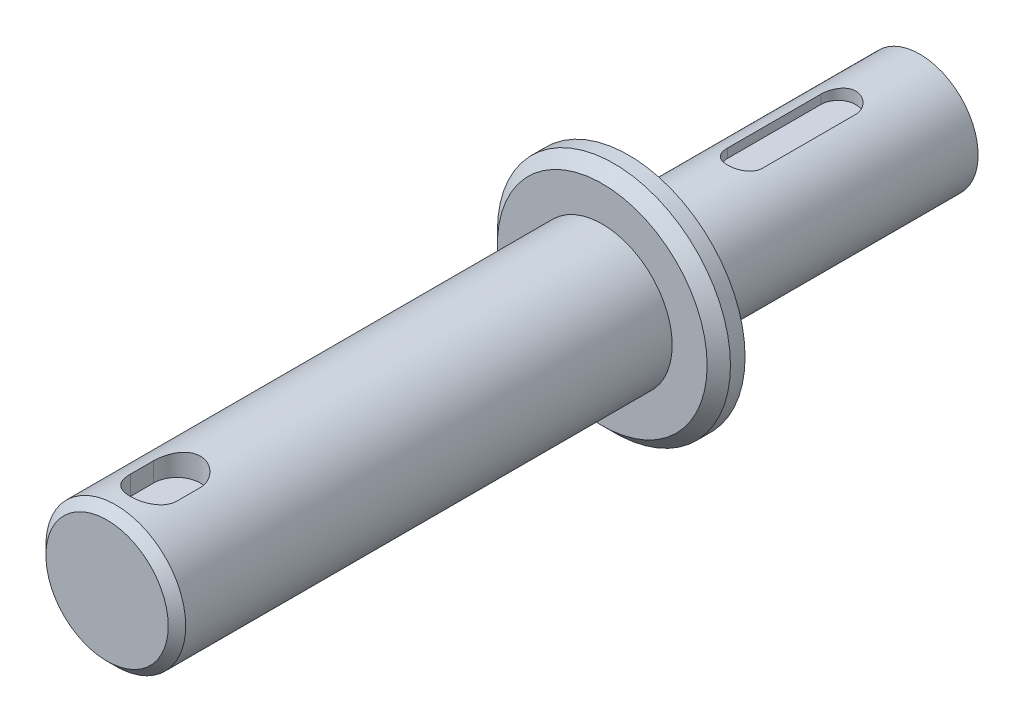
ISO-10303-21;
HEADER;
FILE_DESCRIPTION(('STEP AP214'),'2;1');
FILE_NAME('part.step','',(''),(''),'','','');
FILE_SCHEMA(('AUTOMOTIVE_DESIGN { 1 0 10303 214 1 1 1 1 }'));
ENDSEC;
DATA;
#1=APPLICATION_CONTEXT('core data for automotive mechanical design processes');
#2=APPLICATION_PROTOCOL_DEFINITION('international standard','automotive_design',2000,#1);
#3=PRODUCT_CONTEXT('',#1,'mechanical');
#4=PRODUCT('Part','Part','',(#3));
#5=PRODUCT_RELATED_PRODUCT_CATEGORY('part','',(#4));
#6=PRODUCT_DEFINITION_FORMATION('','',#4);
#7=PRODUCT_DEFINITION_CONTEXT('part definition',#1,'design');
#8=PRODUCT_DEFINITION('design','',#6,#7);
#9=PRODUCT_DEFINITION_SHAPE('','',#8);
#10=(LENGTH_UNIT() NAMED_UNIT(*) SI_UNIT(.MILLI.,.METRE.));
#11=(NAMED_UNIT(*) PLANE_ANGLE_UNIT() SI_UNIT($,.RADIAN.));
#12=(NAMED_UNIT(*) SI_UNIT($,.STERADIAN.) SOLID_ANGLE_UNIT());
#13=UNCERTAINTY_MEASURE_WITH_UNIT(LENGTH_MEASURE(1.E-05),#10,'distance_accuracy_value','');
#14=(GEOMETRIC_REPRESENTATION_CONTEXT(3) GLOBAL_UNCERTAINTY_ASSIGNED_CONTEXT((#13)) GLOBAL_UNIT_ASSIGNED_CONTEXT((#10,
#11,#12)) REPRESENTATION_CONTEXT('',''));
#15=CARTESIAN_POINT('',(0.,0.,0.));
#16=DIRECTION('',(0.,0.,1.));
#17=DIRECTION('',(1.,0.,0.));
#18=AXIS2_PLACEMENT_3D('',#15,#16,#17);
#19=CARTESIAN_POINT('',(0.,0.,89.51));
#20=DIRECTION('',(0.,0.,-1.));
#21=DIRECTION('',(-1.,0.,0.));
#22=AXIS2_PLACEMENT_3D('',#19,#20,#21);
#23=CYLINDRICAL_SURFACE('',#22,12.);
#24=CARTESIAN_POINT('',(0.,0.,4.51));
#25=DIRECTION('',(0.,0.,1.));
#26=DIRECTION('',(1.,0.,0.));
#27=AXIS2_PLACEMENT_3D('',#24,#25,#26);
#28=CIRCLE('',#27,12.);
#29=CARTESIAN_POINT('',(12.,0.,4.51));
#30=VERTEX_POINT('',#29);
#31=EDGE_CURVE('E157',#30,#30,#28,.T.);
#32=ORIENTED_EDGE('',*,*,#31,.T.);
#33=EDGE_LOOP('',(#32));
#34=FACE_BOUND('',#33,.T.);
#35=CARTESIAN_POINT('',(0.,0.,88.01));
#36=DIRECTION('',(0.,0.,1.));
#37=DIRECTION('',(1.,0.,0.));
#38=AXIS2_PLACEMENT_3D('',#35,#36,#37);
#39=CIRCLE('',#38,12.);
#40=CARTESIAN_POINT('',(12.,0.,88.01));
#41=VERTEX_POINT('',#40);
#42=EDGE_CURVE('E173',#41,#41,#39,.F.);
#43=ORIENTED_EDGE('',*,*,#42,.T.);
#44=EDGE_LOOP('',(#43));
#45=FACE_BOUND('',#44,.T.);
#46=CARTESIAN_POINT('',(-4.,11.3137084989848,81.51));
#47=CARTESIAN_POINT('',(-4.0000143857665,11.3136910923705,81.6191313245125));
#48=CARTESIAN_POINT('',(-3.99553419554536,11.3152871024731,81.7282529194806));
#49=CARTESIAN_POINT('',(-3.97769673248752,11.3215763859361,81.9456496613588));
#50=CARTESIAN_POINT('',(-3.96434185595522,11.3262688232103,82.0539250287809));
#51=CARTESIAN_POINT('',(-3.92891935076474,11.3386032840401,82.2685447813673));
#52=CARTESIAN_POINT('',(-3.90687756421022,11.3462365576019,82.3748939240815));
#53=CARTESIAN_POINT('',(-3.85430689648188,11.364201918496,82.5852132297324));
#54=CARTESIAN_POINT('',(-3.82377770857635,11.3745341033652,82.6891833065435));
#55=CARTESIAN_POINT('',(-3.71986482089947,11.4091190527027,82.9963385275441));
#56=CARTESIAN_POINT('',(-3.63410266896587,11.4369799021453,83.195086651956));
#57=CARTESIAN_POINT('',(-3.4322845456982,11.4991525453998,83.5754028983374));
#58=CARTESIAN_POINT('',(-3.31620997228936,11.5334682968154,83.756960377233));
#59=CARTESIAN_POINT('',(-3.05220793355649,11.6061789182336,84.1048686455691));
#60=CARTESIAN_POINT('',(-2.90330055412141,11.6446750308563,84.2704562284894));
#61=CARTESIAN_POINT('',(-2.57995313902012,11.7205540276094,84.5748273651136));
#62=CARTESIAN_POINT('',(-2.40550856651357,11.7579367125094,84.713606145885));
#63=CARTESIAN_POINT('',(-2.03041476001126,11.8285552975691,84.9639171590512));
#64=CARTESIAN_POINT('',(-1.82920040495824,11.8616574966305,85.0746436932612));
#65=CARTESIAN_POINT('',(-1.40971695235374,11.9187843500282,85.2603692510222));
#66=CARTESIAN_POINT('',(-1.19145308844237,11.9428117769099,85.3353791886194));
#67=CARTESIAN_POINT('',(-0.752117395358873,11.9783628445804,85.4449428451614));
#68=CARTESIAN_POINT('',(-0.531407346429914,11.9902923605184,85.4808130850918));
#69=CARTESIAN_POINT('',(-0.0867958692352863,12.0017443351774,85.5152651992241));
#70=CARTESIAN_POINT('',(0.13710478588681,12.0012697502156,85.5138559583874));
#71=CARTESIAN_POINT('',(0.572415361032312,11.9882415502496,85.4746229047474));
#72=CARTESIAN_POINT('',(0.783970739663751,11.9761624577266,85.4382295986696));
#73=CARTESIAN_POINT('',(1.19777632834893,11.9418784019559,85.3324270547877));
#74=CARTESIAN_POINT('',(1.4000260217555,11.9196728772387,85.2630159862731));
#75=CARTESIAN_POINT('',(1.79261022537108,11.8670267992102,85.0923150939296));
#76=CARTESIAN_POINT('',(1.98275302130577,11.8364817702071,84.9906179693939));
#77=CARTESIAN_POINT('',(2.34369935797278,11.7703352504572,84.7585580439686));
#78=CARTESIAN_POINT('',(2.51449761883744,11.7347323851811,84.6281874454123));
#79=CARTESIAN_POINT('',(2.84038544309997,11.6602518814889,84.3353242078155));
#80=CARTESIAN_POINT('',(2.99435951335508,11.6212989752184,84.1716098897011));
#81=CARTESIAN_POINT('',(3.27310303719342,11.5458957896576,83.8202019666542));
#82=CARTESIAN_POINT('',(3.39786305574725,11.5094463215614,83.6325006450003));
#83=CARTESIAN_POINT('',(3.56109757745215,11.4595759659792,83.3352870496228));
#84=CARTESIAN_POINT('',(3.61182358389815,11.4436484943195,83.2327445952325));
#85=CARTESIAN_POINT('',(3.70440095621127,11.4140167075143,83.0234350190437));
#86=CARTESIAN_POINT('',(3.74625601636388,11.4003114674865,82.9166696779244));
#87=CARTESIAN_POINT('',(3.82067426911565,11.3755873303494,82.6997829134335));
#88=CARTESIAN_POINT('',(3.85324757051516,11.3645655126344,82.5896652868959));
#89=CARTESIAN_POINT('',(3.90883841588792,11.3455648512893,82.3668318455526));
#90=CARTESIAN_POINT('',(3.93186032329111,11.3375846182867,82.2541172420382));
#91=CARTESIAN_POINT('',(3.96661962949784,11.3254693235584,82.0363575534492));
#92=CARTESIAN_POINT('',(3.97913375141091,11.3210705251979,81.9314504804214));
#93=CARTESIAN_POINT('',(3.99582494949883,11.3151843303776,81.7210316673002));
#94=CARTESIAN_POINT('',(4.00001278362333,11.3136931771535,81.6155208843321));
#95=CARTESIAN_POINT('',(4.,11.3137084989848,81.51));
#96=B_SPLINE_CURVE_WITH_KNOTS('',3,(#46,#47,#48,#49,#50,#51,#52,#53,#54,#55,#56,#57,#58,#59,#60,
#61,#62,#63,#64,#65,#66,#67,#68,#69,#70,#71,#72,#73,#74,#75,#76,#77,#78,#79,#80,#81,#82,#83,#84,
#85,#86,#87,#88,#89,#90,#91,#92,#93,#94,#95),.UNSPECIFIED.,.F.,.F.,(4,2,2,2,2,2,2,2,2,2,2,2,2,2,
2,2,2,2,2,2,2,2,2,2,4),(0.,0.327273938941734,0.654459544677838,0.980679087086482,
1.30691042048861,1.95841627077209,2.61032287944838,3.28524582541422,3.96028882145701,
4.65295094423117,5.34540127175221,6.01376445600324,6.68196834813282,7.32396236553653,
7.96599198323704,8.61646637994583,9.26711789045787,9.94834778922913,10.6297973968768,
10.9759539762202,11.3219661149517,11.6675999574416,12.0130757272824,12.3299368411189,
12.6463882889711),.UNSPECIFIED.);
#97=CARTESIAN_POINT('',(-4.,11.3137084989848,81.51));
#98=VERTEX_POINT('',#97);
#99=CARTESIAN_POINT('',(4.,11.3137084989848,81.51));
#100=VERTEX_POINT('',#99);
#101=EDGE_CURVE('E138',#98,#100,#96,.T.);
#102=ORIENTED_EDGE('',*,*,#101,.F.);
#103=DIRECTION('',(0.,0.,-1.));
#104=VECTOR('',#103,1.);
#105=CARTESIAN_POINT('',(-4.,11.3137084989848,89.51));
#106=LINE('',#105,#104);
#107=CARTESIAN_POINT('',(-4.,11.3137084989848,77.51));
#108=VERTEX_POINT('',#107);
#109=EDGE_CURVE('E176',#108,#98,#106,.F.);
#110=ORIENTED_EDGE('',*,*,#109,.F.);
#111=CARTESIAN_POINT('',(4.,11.3137084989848,77.51));
#112=CARTESIAN_POINT('',(4.0000143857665,11.3136910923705,77.4008686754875));
#113=CARTESIAN_POINT('',(3.99553419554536,11.3152871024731,77.2917470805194));
#114=CARTESIAN_POINT('',(3.97769673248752,11.3215763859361,77.0743503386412));
#115=CARTESIAN_POINT('',(3.96434185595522,11.3262688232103,76.9660749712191));
#116=CARTESIAN_POINT('',(3.92891935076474,11.3386032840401,76.7514552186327));
#117=CARTESIAN_POINT('',(3.90687756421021,11.3462365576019,76.6451060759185));
#118=CARTESIAN_POINT('',(3.85430689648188,11.364201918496,76.4347867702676));
#119=CARTESIAN_POINT('',(3.82377770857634,11.3745341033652,76.3308166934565));
#120=CARTESIAN_POINT('',(3.71986482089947,11.4091190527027,76.0236614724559));
#121=CARTESIAN_POINT('',(3.63410266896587,11.4369799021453,75.824913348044));
#122=CARTESIAN_POINT('',(3.4322845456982,11.4991525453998,75.4445971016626));
#123=CARTESIAN_POINT('',(3.31620997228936,11.5334682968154,75.263039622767));
#124=CARTESIAN_POINT('',(3.05220793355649,11.6061789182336,74.9151313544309));
#125=CARTESIAN_POINT('',(2.90330055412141,11.6446750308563,74.7495437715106));
#126=CARTESIAN_POINT('',(2.57995313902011,11.7205540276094,74.4451726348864));
#127=CARTESIAN_POINT('',(2.40550856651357,11.7579367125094,74.306393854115));
#128=CARTESIAN_POINT('',(2.03041476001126,11.8285552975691,74.0560828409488));
#129=CARTESIAN_POINT('',(1.82920040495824,11.8616574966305,73.9453563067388));
#130=CARTESIAN_POINT('',(1.40971695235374,11.9187843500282,73.7596307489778));
#131=CARTESIAN_POINT('',(1.19145308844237,11.9428117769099,73.6846208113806));
#132=CARTESIAN_POINT('',(0.752117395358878,11.9783628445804,73.5750571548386));
#133=CARTESIAN_POINT('',(0.531407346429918,11.9902923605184,73.5391869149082));
#134=CARTESIAN_POINT('',(0.0867958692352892,12.0017443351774,73.5047348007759));
#135=CARTESIAN_POINT('',(-0.137104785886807,12.0012697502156,73.5061440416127));
#136=CARTESIAN_POINT('',(-0.57241536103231,11.9882415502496,73.5453770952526));
#137=CARTESIAN_POINT('',(-0.783970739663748,11.9761624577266,73.5817704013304));
#138=CARTESIAN_POINT('',(-1.19777632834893,11.9418784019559,73.6875729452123));
#139=CARTESIAN_POINT('',(-1.40002602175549,11.9196728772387,73.7569840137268));
#140=CARTESIAN_POINT('',(-1.79261022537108,11.8670267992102,73.9276849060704));
#141=CARTESIAN_POINT('',(-1.98275302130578,11.8364817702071,74.0293820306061));
#142=CARTESIAN_POINT('',(-2.34369935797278,11.7703352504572,74.2614419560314));
#143=CARTESIAN_POINT('',(-2.51449761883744,11.7347323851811,74.3918125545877));
#144=CARTESIAN_POINT('',(-2.84038544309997,11.6602518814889,74.6846757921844));
#145=CARTESIAN_POINT('',(-2.99435951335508,11.6212989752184,74.8483901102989));
#146=CARTESIAN_POINT('',(-3.27310303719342,11.5458957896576,75.1997980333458));
#147=CARTESIAN_POINT('',(-3.39786305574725,11.5094463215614,75.3874993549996));
#148=CARTESIAN_POINT('',(-3.56109757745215,11.4595759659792,75.6847129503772));
#149=CARTESIAN_POINT('',(-3.61182358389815,11.4436484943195,75.7872554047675));
#150=CARTESIAN_POINT('',(-3.70440095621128,11.4140167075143,75.9965649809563));
#151=CARTESIAN_POINT('',(-3.74625601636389,11.4003114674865,76.1033303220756));
#152=CARTESIAN_POINT('',(-3.82067426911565,11.3755873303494,76.3202170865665));
#153=CARTESIAN_POINT('',(-3.85324757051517,11.3645655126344,76.4303347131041));
#154=CARTESIAN_POINT('',(-3.90883841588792,11.3455648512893,76.6531681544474));
#155=CARTESIAN_POINT('',(-3.93186032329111,11.3375846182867,76.7658827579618));
#156=CARTESIAN_POINT('',(-3.96661962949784,11.3254693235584,76.9836424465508));
#157=CARTESIAN_POINT('',(-3.97913375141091,11.3210705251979,77.0885495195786));
#158=CARTESIAN_POINT('',(-3.99582494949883,11.3151843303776,77.2989683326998));
#159=CARTESIAN_POINT('',(-4.00001278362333,11.3136931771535,77.4044791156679));
#160=CARTESIAN_POINT('',(-4.,11.3137084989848,77.51));
#161=B_SPLINE_CURVE_WITH_KNOTS('',3,(#111,#112,#113,#114,#115,#116,#117,#118,#119,#120,#121,
#122,#123,#124,#125,#126,#127,#128,#129,#130,#131,#132,#133,#134,#135,#136,#137,#138,#139,#140,
#141,#142,#143,#144,#145,#146,#147,#148,#149,#150,#151,#152,#153,#154,#155,#156,#157,#158,#159,
#160),.UNSPECIFIED.,.F.,.F.,(4,2,2,2,2,2,2,2,2,2,2,2,2,2,2,2,2,2,2,2,2,2,2,2,4),(0.,
0.327273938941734,0.654459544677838,0.98067908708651,1.30691042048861,1.95841627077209,
2.61032287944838,3.28524582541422,3.96028882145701,4.65295094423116,5.3454012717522,
6.01376445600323,6.68196834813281,7.32396236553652,7.96599198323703,8.61646637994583,
9.26711789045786,9.94834778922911,10.6297973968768,10.9759539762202,11.3219661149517,
11.6675999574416,12.0130757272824,12.3299368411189,12.6463882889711),.UNSPECIFIED.);
#162=CARTESIAN_POINT('',(4.,11.3137084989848,77.51));
#163=VERTEX_POINT('',#162);
#164=EDGE_CURVE('E178',#163,#108,#161,.T.);
#165=ORIENTED_EDGE('',*,*,#164,.F.);
#166=DIRECTION('',(0.,0.,-1.));
#167=VECTOR('',#166,1.);
#168=CARTESIAN_POINT('',(4.,11.3137084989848,89.51));
#169=LINE('',#168,#167);
#170=EDGE_CURVE('E186',#100,#163,#169,.T.);
#171=ORIENTED_EDGE('',*,*,#170,.F.);
#172=EDGE_LOOP('',(#102,#110,#165,#171));
#173=FACE_BOUND('',#172,.T.);
#174=ADVANCED_FACE('F34',(#34,#45,#173),#23,.T.);
#175=CARTESIAN_POINT('',(0.,0.,4.51));
#176=DIRECTION('',(0.,0.,-1.));
#177=DIRECTION('',(-1.,0.,0.));
#178=AXIS2_PLACEMENT_3D('',#175,#176,#177);
#179=CYLINDRICAL_SURFACE('',#178,20.);
#180=CARTESIAN_POINT('',(0.,0.,2.50999999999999));
#181=DIRECTION('',(0.,0.,1.));
#182=DIRECTION('',(1.,0.,0.));
#183=AXIS2_PLACEMENT_3D('',#180,#181,#182);
#184=CIRCLE('',#183,20.);
#185=CARTESIAN_POINT('',(20.,0.,2.50999999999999));
#186=VERTEX_POINT('',#185);
#187=EDGE_CURVE('E166',#186,#186,#184,.F.);
#188=ORIENTED_EDGE('',*,*,#187,.T.);
#189=EDGE_LOOP('',(#188));
#190=FACE_BOUND('',#189,.T.);
#191=CARTESIAN_POINT('',(0.,0.,0.));
#192=DIRECTION('',(0.,0.,1.));
#193=DIRECTION('',(1.,0.,0.));
#194=AXIS2_PLACEMENT_3D('',#191,#192,#193);
#195=CIRCLE('',#194,20.);
#196=CARTESIAN_POINT('',(20.,0.,0.));
#197=VERTEX_POINT('',#196);
#198=EDGE_CURVE('E160',#197,#197,#195,.T.);
#199=ORIENTED_EDGE('',*,*,#198,.T.);
#200=EDGE_LOOP('',(#199));
#201=FACE_BOUND('',#200,.T.);
#202=ADVANCED_FACE('F249',(#190,#201),#179,.T.);
#203=CARTESIAN_POINT('',(0.,0.,4.51));
#204=DIRECTION('',(0.,0.,1.));
#205=DIRECTION('',(1.,0.,0.));
#206=AXIS2_PLACEMENT_3D('',#203,#204,#205);
#207=PLANE('',#206);
#208=ORIENTED_EDGE('',*,*,#31,.F.);
#209=EDGE_LOOP('',(#208));
#210=FACE_BOUND('',#209,.T.);
#211=CARTESIAN_POINT('',(0.,0.,4.51));
#212=DIRECTION('',(0.,0.,1.));
#213=DIRECTION('',(1.,0.,0.));
#214=AXIS2_PLACEMENT_3D('',#211,#212,#213);
#215=CIRCLE('',#214,18.);
#216=CARTESIAN_POINT('',(18.,0.,4.51));
#217=VERTEX_POINT('',#216);
#218=EDGE_CURVE('E163',#217,#217,#215,.T.);
#219=ORIENTED_EDGE('',*,*,#218,.T.);
#220=EDGE_LOOP('',(#219));
#221=FACE_BOUND('',#220,.T.);
#222=ADVANCED_FACE('F254',(#210,#221),#207,.T.);
#223=CARTESIAN_POINT('',(0.,0.,0.));
#224=DIRECTION('',(0.,0.,1.));
#225=DIRECTION('',(1.,0.,0.));
#226=AXIS2_PLACEMENT_3D('',#223,#224,#225);
#227=PLANE('',#226);
#228=CARTESIAN_POINT('',(0.,0.,0.));
#229=DIRECTION('',(0.,0.,-1.));
#230=DIRECTION('',(-1.,0.,0.));
#231=AXIS2_PLACEMENT_3D('',#228,#229,#230);
#232=CIRCLE('',#231,10.);
#233=CARTESIAN_POINT('',(-10.,0.,0.));
#234=VERTEX_POINT('',#233);
#235=EDGE_CURVE('E134',#234,#234,#232,.T.);
#236=ORIENTED_EDGE('',*,*,#235,.F.);
#237=EDGE_LOOP('',(#236));
#238=FACE_BOUND('',#237,.T.);
#239=ORIENTED_EDGE('',*,*,#198,.F.);
#240=EDGE_LOOP('',(#239));
#241=FACE_BOUND('',#240,.T.);
#242=ADVANCED_FACE('F327',(#238,#241),#227,.F.);
#243=CARTESIAN_POINT('',(0.,0.,4.51));
#244=DIRECTION('',(0.,0.,-1.));
#245=DIRECTION('',(-1.,0.,0.));
#246=AXIS2_PLACEMENT_3D('',#243,#244,#245);
#247=CONICAL_SURFACE('',#246,18.,0.785398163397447);
#248=ORIENTED_EDGE('',*,*,#187,.F.);
#249=EDGE_LOOP('',(#248));
#250=FACE_BOUND('',#249,.T.);
#251=ORIENTED_EDGE('',*,*,#218,.F.);
#252=EDGE_LOOP('',(#251));
#253=FACE_BOUND('',#252,.T.);
#254=ADVANCED_FACE('F330',(#250,#253),#247,.T.);
#255=CARTESIAN_POINT('',(0.,0.,89.51));
#256=DIRECTION('',(0.,0.,1.));
#257=DIRECTION('',(1.,0.,0.));
#258=AXIS2_PLACEMENT_3D('',#255,#256,#257);
#259=PLANE('',#258);
#260=CARTESIAN_POINT('',(0.,0.,89.51));
#261=DIRECTION('',(0.,0.,1.));
#262=DIRECTION('',(1.,0.,0.));
#263=AXIS2_PLACEMENT_3D('',#260,#261,#262);
#264=CIRCLE('',#263,10.5);
#265=CARTESIAN_POINT('',(10.5,0.,89.51));
#266=VERTEX_POINT('',#265);
#267=EDGE_CURVE('E169',#266,#266,#264,.T.);
#268=ORIENTED_EDGE('',*,*,#267,.T.);
#269=EDGE_LOOP('',(#268));
#270=FACE_BOUND('',#269,.T.);
#271=ADVANCED_FACE('F207',(#270),#259,.T.);
#272=CARTESIAN_POINT('',(0.,0.,89.51));
#273=DIRECTION('',(0.,0.,-1.));
#274=DIRECTION('',(-1.,0.,0.));
#275=AXIS2_PLACEMENT_3D('',#272,#273,#274);
#276=CONICAL_SURFACE('',#275,10.5,0.785398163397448);
#277=ORIENTED_EDGE('',*,*,#42,.F.);
#278=EDGE_LOOP('',(#277));
#279=FACE_BOUND('',#278,.T.);
#280=ORIENTED_EDGE('',*,*,#267,.F.);
#281=EDGE_LOOP('',(#280));
#282=FACE_BOUND('',#281,.T.);
#283=ADVANCED_FACE('F36',(#279,#282),#276,.T.);
#284=CARTESIAN_POINT('',(0.,20.,81.51));
#285=DIRECTION('',(0.,-1.,0.));
#286=DIRECTION('',(0.,0.,-1.));
#287=AXIS2_PLACEMENT_3D('',#284,#285,#286);
#288=CYLINDRICAL_SURFACE('',#287,4.);
#289=ORIENTED_EDGE('',*,*,#101,.T.);
#290=DIRECTION('',(0.,-1.,0.));
#291=VECTOR('',#290,1.);
#292=CARTESIAN_POINT('',(4.,20.,81.51));
#293=LINE('',#292,#291);
#294=CARTESIAN_POINT('',(4.,8.,81.51));
#295=VERTEX_POINT('',#294);
#296=EDGE_CURVE('E155',#100,#295,#293,.T.);
#297=ORIENTED_EDGE('',*,*,#296,.T.);
#298=CARTESIAN_POINT('',(0.,8.,81.51));
#299=DIRECTION('',(0.,1.,0.));
#300=DIRECTION('',(0.,0.,1.));
#301=AXIS2_PLACEMENT_3D('',#298,#299,#300);
#302=CIRCLE('',#301,4.);
#303=CARTESIAN_POINT('',(-4.,8.,81.51));
#304=VERTEX_POINT('',#303);
#305=EDGE_CURVE('E133',#304,#295,#302,.T.);
#306=ORIENTED_EDGE('',*,*,#305,.F.);
#307=DIRECTION('',(0.,-1.,0.));
#308=VECTOR('',#307,1.);
#309=CARTESIAN_POINT('',(-4.,20.,81.51));
#310=LINE('',#309,#308);
#311=EDGE_CURVE('E150',#98,#304,#310,.T.);
#312=ORIENTED_EDGE('',*,*,#311,.F.);
#313=EDGE_LOOP('',(#289,#297,#306,#312));
#314=FACE_BOUND('',#313,.T.);
#315=ADVANCED_FACE('F202',(#314),#288,.F.);
#316=CARTESIAN_POINT('',(4.,20.,77.51));
#317=DIRECTION('',(-1.,0.,0.));
#318=DIRECTION('',(0.,0.,1.));
#319=AXIS2_PLACEMENT_3D('',#316,#317,#318);
#320=PLANE('',#319);
#321=ORIENTED_EDGE('',*,*,#170,.T.);
#322=DIRECTION('',(0.,-1.,0.));
#323=VECTOR('',#322,1.);
#324=CARTESIAN_POINT('',(4.,20.,77.51));
#325=LINE('',#324,#323);
#326=CARTESIAN_POINT('',(4.,8.,77.51));
#327=VERTEX_POINT('',#326);
#328=EDGE_CURVE('E153',#163,#327,#325,.T.);
#329=ORIENTED_EDGE('',*,*,#328,.T.);
#330=DIRECTION('',(0.,0.,-1.));
#331=VECTOR('',#330,1.);
#332=CARTESIAN_POINT('',(4.,8.,77.51));
#333=LINE('',#332,#331);
#334=EDGE_CURVE('E141',#295,#327,#333,.T.);
#335=ORIENTED_EDGE('',*,*,#334,.F.);
#336=ORIENTED_EDGE('',*,*,#296,.F.);
#337=EDGE_LOOP('',(#321,#329,#335,#336));
#338=FACE_BOUND('',#337,.T.);
#339=ADVANCED_FACE('F197',(#338),#320,.T.);
#340=CARTESIAN_POINT('',(0.,20.,77.51));
#341=DIRECTION('',(0.,-1.,0.));
#342=DIRECTION('',(0.,0.,-1.));
#343=AXIS2_PLACEMENT_3D('',#340,#341,#342);
#344=CYLINDRICAL_SURFACE('',#343,4.);
#345=ORIENTED_EDGE('',*,*,#164,.T.);
#346=DIRECTION('',(0.,-1.,0.));
#347=VECTOR('',#346,1.);
#348=CARTESIAN_POINT('',(-4.,20.,77.51));
#349=LINE('',#348,#347);
#350=CARTESIAN_POINT('',(-4.,8.,77.51));
#351=VERTEX_POINT('',#350);
#352=EDGE_CURVE('E57',#108,#351,#349,.T.);
#353=ORIENTED_EDGE('',*,*,#352,.T.);
#354=CARTESIAN_POINT('',(0.,8.,77.51));
#355=DIRECTION('',(0.,1.,0.));
#356=DIRECTION('',(0.,0.,1.));
#357=AXIS2_PLACEMENT_3D('',#354,#355,#356);
#358=CIRCLE('',#357,4.);
#359=EDGE_CURVE('E144',#327,#351,#358,.T.);
#360=ORIENTED_EDGE('',*,*,#359,.F.);
#361=ORIENTED_EDGE('',*,*,#328,.F.);
#362=EDGE_LOOP('',(#345,#353,#360,#361));
#363=FACE_BOUND('',#362,.T.);
#364=ADVANCED_FACE('F191',(#363),#344,.F.);
#365=CARTESIAN_POINT('',(-4.,20.,77.51));
#366=DIRECTION('',(1.,0.,0.));
#367=DIRECTION('',(0.,0.,-1.));
#368=AXIS2_PLACEMENT_3D('',#365,#366,#367);
#369=PLANE('',#368);
#370=ORIENTED_EDGE('',*,*,#109,.T.);
#371=ORIENTED_EDGE('',*,*,#311,.T.);
#372=DIRECTION('',(0.,0.,1.));
#373=VECTOR('',#372,1.);
#374=CARTESIAN_POINT('',(-4.,8.,77.51));
#375=LINE('',#374,#373);
#376=EDGE_CURVE('E147',#351,#304,#375,.T.);
#377=ORIENTED_EDGE('',*,*,#376,.F.);
#378=ORIENTED_EDGE('',*,*,#352,.F.);
#379=EDGE_LOOP('',(#370,#371,#377,#378));
#380=FACE_BOUND('',#379,.T.);
#381=ADVANCED_FACE('F196',(#380),#369,.T.);
#382=CARTESIAN_POINT('',(0.,8.,81.51));
#383=DIRECTION('',(0.,1.,0.));
#384=DIRECTION('',(0.,0.,1.));
#385=AXIS2_PLACEMENT_3D('',#382,#383,#384);
#386=PLANE('',#385);
#387=ORIENTED_EDGE('',*,*,#305,.T.);
#388=ORIENTED_EDGE('',*,*,#334,.T.);
#389=ORIENTED_EDGE('',*,*,#359,.T.);
#390=ORIENTED_EDGE('',*,*,#376,.T.);
#391=EDGE_LOOP('',(#387,#388,#389,#390));
#392=FACE_BOUND('',#391,.T.);
#393=ADVANCED_FACE('F246',(#392),#386,.T.);
#394=CARTESIAN_POINT('',(0.,0.,-50.));
#395=DIRECTION('',(0.,0.,1.));
#396=DIRECTION('',(1.,0.,0.));
#397=AXIS2_PLACEMENT_3D('',#394,#395,#396);
#398=CYLINDRICAL_SURFACE('',#397,10.);
#399=DIRECTION('',(0.,0.,1.));
#400=VECTOR('',#399,1.);
#401=CARTESIAN_POINT('',(-3.,9.53939201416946,-50.));
#402=LINE('',#401,#400);
#403=CARTESIAN_POINT('',(-3.,9.53939201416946,-20.));
#404=VERTEX_POINT('',#403);
#405=CARTESIAN_POINT('',(-3.,9.53939201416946,-36.));
#406=VERTEX_POINT('',#405);
#407=EDGE_CURVE('E11',#404,#406,#402,.F.);
#408=ORIENTED_EDGE('',*,*,#407,.T.);
#409=CARTESIAN_POINT('',(-3.,9.53939201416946,-36.));
#410=CARTESIAN_POINT('',(-3.00001027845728,9.53938054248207,-36.0823355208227));
#411=CARTESIAN_POINT('',(-2.99661062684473,9.54045772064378,-36.1646644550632));
#412=CARTESIAN_POINT('',(-2.98307142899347,9.54470412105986,-36.3286939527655));
#413=CARTESIAN_POINT('',(-2.97293339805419,9.54787287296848,-36.4103946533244));
#414=CARTESIAN_POINT('',(-2.94603140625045,9.55620668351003,-36.5723849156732));
#415=CARTESIAN_POINT('',(-2.92928426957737,9.56136667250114,-36.652677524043));
#416=CARTESIAN_POINT('',(-2.88932853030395,9.57351626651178,-36.8114758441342));
#417=CARTESIAN_POINT('',(-2.86611975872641,9.58050591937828,-36.8899815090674));
#418=CARTESIAN_POINT('',(-2.78708584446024,9.60391637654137,-37.1219493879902));
#419=CARTESIAN_POINT('',(-2.72181852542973,9.62279007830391,-37.272068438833));
#420=CARTESIAN_POINT('',(-2.56815043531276,9.66493213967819,-37.5592260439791));
#421=CARTESIAN_POINT('',(-2.4797388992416,9.68820254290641,-37.6962584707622));
#422=CARTESIAN_POINT('',(-2.27929879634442,9.73733650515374,-37.9577229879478));
#423=CARTESIAN_POINT('',(-2.16666914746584,9.76325505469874,-38.0816848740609));
#424=CARTESIAN_POINT('',(-1.92227736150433,9.81429628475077,-38.3092736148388));
#425=CARTESIAN_POINT('',(-1.79051199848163,9.8394188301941,-38.412897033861));
#426=CARTESIAN_POINT('',(-1.50821997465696,9.88666477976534,-38.5989268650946));
#427=CARTESIAN_POINT('',(-1.35736167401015,9.90871541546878,-38.6808501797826));
#428=CARTESIAN_POINT('',(-1.04324233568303,9.94668940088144,-38.8179770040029));
#429=CARTESIAN_POINT('',(-0.879984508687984,9.96261433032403,-38.873187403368));
#430=CARTESIAN_POINT('',(-0.550649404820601,9.98615279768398,-38.953759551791));
#431=CARTESIAN_POINT('',(-0.384786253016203,9.99399098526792,-38.9799297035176));
#432=CARTESIAN_POINT('',(-0.0508471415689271,10.0012640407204,-39.0042346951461));
#433=CARTESIAN_POINT('',(0.11722839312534,10.0007004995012,-39.0023748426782));
#434=CARTESIAN_POINT('',(0.445143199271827,9.99139205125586,-38.9712141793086));
#435=CARTESIAN_POINT('',(0.605074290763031,9.98290831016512,-38.9427893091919));
#436=CARTESIAN_POINT('',(0.917780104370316,9.95903027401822,-38.8607367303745));
#437=CARTESIAN_POINT('',(1.07055445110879,9.94363561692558,-38.8071077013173));
#438=CARTESIAN_POINT('',(1.36669563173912,9.90730429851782,-38.6755755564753));
#439=CARTESIAN_POINT('',(1.50993201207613,9.88630511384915,-38.5973967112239));
#440=CARTESIAN_POINT('',(1.781531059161,9.84099249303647,-38.4192028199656));
#441=CARTESIAN_POINT('',(1.90989038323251,9.81667831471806,-38.3191828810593));
#442=CARTESIAN_POINT('',(2.15330901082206,9.7662334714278,-38.0956160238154));
#443=CARTESIAN_POINT('',(2.26766702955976,9.74006890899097,-37.9713122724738));
#444=CARTESIAN_POINT('',(2.47413538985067,9.68968430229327,-37.7050051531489));
#445=CARTESIAN_POINT('',(2.5662392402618,9.66546482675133,-37.5629966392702));
#446=CARTESIAN_POINT('',(2.72632814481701,9.62154457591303,-37.2634381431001));
#447=CARTESIAN_POINT('',(2.79406012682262,9.60189192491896,-37.1057456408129));
#448=CARTESIAN_POINT('',(2.90171772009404,9.56991327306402,-36.7805509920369));
#449=CARTESIAN_POINT('',(2.94168586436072,9.55757606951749,-36.6130642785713));
#450=CARTESIAN_POINT('',(2.97802407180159,9.54628064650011,-36.3700102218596));
#451=CARTESIAN_POINT('',(2.98626405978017,9.54370312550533,-36.2962185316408));
#452=CARTESIAN_POINT('',(2.99724711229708,9.54025857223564,-36.148297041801));
#453=CARTESIAN_POINT('',(2.99999825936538,9.53938902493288,-36.0741679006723));
#454=CARTESIAN_POINT('',(3.,9.53939201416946,-36.));
#455=B_SPLINE_CURVE_WITH_KNOTS('',3,(#409,#410,#411,#412,#413,#414,#415,#416,#417,#418,#419,
#420,#421,#422,#423,#424,#425,#426,#427,#428,#429,#430,#431,#432,#433,#434,#435,#436,#437,#438,
#439,#440,#441,#442,#443,#444,#445,#446,#447,#448,#449,#450,#451,#452,#453,#454),.UNSPECIFIED.,
.F.,.F.,(4,2,2,2,2,2,2,2,2,2,2,2,2,2,2,2,2,2,2,2,2,2,4),(0.,0.246918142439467,0.493780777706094,
0.740019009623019,0.986263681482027,1.47813347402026,1.97023245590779,2.47635119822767,
2.98255536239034,3.49922810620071,4.01576751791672,4.51753600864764,5.01920948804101,
5.50490358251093,5.99062312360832,6.48200583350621,6.9734987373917,7.48389234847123,
7.99443465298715,8.51013494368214,9.02504345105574,9.24774267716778,9.47011372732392),.UNSPECIFIED.);
#456=CARTESIAN_POINT('',(3.,9.53939201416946,-36.));
#457=VERTEX_POINT('',#456);
#458=EDGE_CURVE('E137',#406,#457,#455,.T.);
#459=ORIENTED_EDGE('',*,*,#458,.T.);
#460=DIRECTION('',(0.,0.,1.));
#461=VECTOR('',#460,1.);
#462=CARTESIAN_POINT('',(3.,9.53939201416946,-50.));
#463=LINE('',#462,#461);
#464=CARTESIAN_POINT('',(3.,9.53939201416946,-20.));
#465=VERTEX_POINT('',#464);
#466=EDGE_CURVE('E42',#457,#465,#463,.T.);
#467=ORIENTED_EDGE('',*,*,#466,.T.);
#468=CARTESIAN_POINT('',(3.,9.53939201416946,-20.));
#469=CARTESIAN_POINT('',(3.00001027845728,9.53938054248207,-19.9176644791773));
#470=CARTESIAN_POINT('',(2.99661062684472,9.54045772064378,-19.8353355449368));
#471=CARTESIAN_POINT('',(2.98307142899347,9.54470412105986,-19.6713060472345));
#472=CARTESIAN_POINT('',(2.97293339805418,9.54787287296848,-19.5896053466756));
#473=CARTESIAN_POINT('',(2.94603140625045,9.55620668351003,-19.4276150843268));
#474=CARTESIAN_POINT('',(2.92928426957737,9.56136667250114,-19.347322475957));
#475=CARTESIAN_POINT('',(2.88932853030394,9.57351626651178,-19.1885241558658));
#476=CARTESIAN_POINT('',(2.8661197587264,9.58050591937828,-19.1100184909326));
#477=CARTESIAN_POINT('',(2.78708584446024,9.60391637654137,-18.8780506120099));
#478=CARTESIAN_POINT('',(2.72181852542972,9.62279007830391,-18.727931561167));
#479=CARTESIAN_POINT('',(2.56815043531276,9.66493213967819,-18.440773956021));
#480=CARTESIAN_POINT('',(2.4797388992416,9.6882025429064,-18.3037415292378));
#481=CARTESIAN_POINT('',(2.27929879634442,9.73733650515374,-18.0422770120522));
#482=CARTESIAN_POINT('',(2.16666914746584,9.76325505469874,-17.9183151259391));
#483=CARTESIAN_POINT('',(1.92227736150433,9.81429628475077,-17.6907263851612));
#484=CARTESIAN_POINT('',(1.79051199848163,9.8394188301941,-17.587102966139));
#485=CARTESIAN_POINT('',(1.50821997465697,9.88666477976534,-17.4010731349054));
#486=CARTESIAN_POINT('',(1.35736167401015,9.90871541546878,-17.3191498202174));
#487=CARTESIAN_POINT('',(1.04324233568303,9.94668940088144,-17.1820229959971));
#488=CARTESIAN_POINT('',(0.879984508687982,9.96261433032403,-17.126812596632));
#489=CARTESIAN_POINT('',(0.550649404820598,9.98615279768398,-17.046240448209));
#490=CARTESIAN_POINT('',(0.3847862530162,9.99399098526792,-17.0200702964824));
#491=CARTESIAN_POINT('',(0.0508471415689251,10.0012640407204,-16.995765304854));
#492=CARTESIAN_POINT('',(-0.117228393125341,10.0007004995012,-16.9976251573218));
#493=CARTESIAN_POINT('',(-0.445143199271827,9.99139205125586,-17.0287858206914));
#494=CARTESIAN_POINT('',(-0.60507429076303,9.98290831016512,-17.0572106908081));
#495=CARTESIAN_POINT('',(-0.917780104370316,9.95903027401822,-17.1392632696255));
#496=CARTESIAN_POINT('',(-1.07055445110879,9.94363561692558,-17.1928922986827));
#497=CARTESIAN_POINT('',(-1.36669563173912,9.90730429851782,-17.3244244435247));
#498=CARTESIAN_POINT('',(-1.50993201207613,9.88630511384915,-17.4026032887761));
#499=CARTESIAN_POINT('',(-1.781531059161,9.84099249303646,-17.5807971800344));
#500=CARTESIAN_POINT('',(-1.90989038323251,9.81667831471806,-17.6808171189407));
#501=CARTESIAN_POINT('',(-2.15330901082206,9.7662334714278,-17.9043839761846));
#502=CARTESIAN_POINT('',(-2.26766702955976,9.74006890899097,-18.0286877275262));
#503=CARTESIAN_POINT('',(-2.47413538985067,9.68968430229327,-18.2949948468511));
#504=CARTESIAN_POINT('',(-2.5662392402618,9.66546482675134,-18.4370033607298));
#505=CARTESIAN_POINT('',(-2.72632814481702,9.62154457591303,-18.7365618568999));
#506=CARTESIAN_POINT('',(-2.79406012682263,9.60189192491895,-18.8942543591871));
#507=CARTESIAN_POINT('',(-2.90171772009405,9.56991327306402,-19.2194490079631));
#508=CARTESIAN_POINT('',(-2.94168586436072,9.55757606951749,-19.3869357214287));
#509=CARTESIAN_POINT('',(-2.97802407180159,9.54628064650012,-19.6299897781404));
#510=CARTESIAN_POINT('',(-2.98626405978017,9.54370312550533,-19.7037814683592));
#511=CARTESIAN_POINT('',(-2.99724711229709,9.54025857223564,-19.851702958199));
#512=CARTESIAN_POINT('',(-2.99999825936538,9.53938902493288,-19.9258320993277));
#513=CARTESIAN_POINT('',(-3.,9.53939201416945,-20.));
#514=B_SPLINE_CURVE_WITH_KNOTS('',3,(#468,#469,#470,#471,#472,#473,#474,#475,#476,#477,#478,
#479,#480,#481,#482,#483,#484,#485,#486,#487,#488,#489,#490,#491,#492,#493,#494,#495,#496,#497,
#498,#499,#500,#501,#502,#503,#504,#505,#506,#507,#508,#509,#510,#511,#512,#513),.UNSPECIFIED.,
.F.,.F.,(4,2,2,2,2,2,2,2,2,2,2,2,2,2,2,2,2,2,2,2,2,2,4),(0.,0.246918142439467,0.493780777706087,
0.740019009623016,0.986263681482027,1.47813347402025,1.97023245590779,2.47635119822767,
2.98255536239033,3.49922810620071,4.01576751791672,4.51753600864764,5.01920948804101,
5.50490358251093,5.99062312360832,6.48200583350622,6.9734987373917,7.48389234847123,
7.99443465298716,8.51013494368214,9.02504345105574,9.24774267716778,9.47011372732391),.UNSPECIFIED.);
#515=EDGE_CURVE('E49',#465,#404,#514,.T.);
#516=ORIENTED_EDGE('',*,*,#515,.T.);
#517=EDGE_LOOP('',(#408,#459,#467,#516));
#518=FACE_BOUND('',#517,.T.);
#519=CARTESIAN_POINT('',(0.,0.,-50.));
#520=DIRECTION('',(0.,0.,-1.));
#521=DIRECTION('',(-1.,0.,0.));
#522=AXIS2_PLACEMENT_3D('',#519,#520,#521);
#523=CIRCLE('',#522,10.);
#524=CARTESIAN_POINT('',(-10.,0.,-50.));
#525=VERTEX_POINT('',#524);
#526=EDGE_CURVE('E126',#525,#525,#523,.T.);
#527=ORIENTED_EDGE('',*,*,#526,.F.);
#528=EDGE_LOOP('',(#527));
#529=FACE_BOUND('',#528,.T.);
#530=ORIENTED_EDGE('',*,*,#235,.T.);
#531=EDGE_LOOP('',(#530));
#532=FACE_BOUND('',#531,.T.);
#533=ADVANCED_FACE('F226',(#518,#529,#532),#398,.T.);
#534=CARTESIAN_POINT('',(0.,0.,-50.));
#535=DIRECTION('',(0.,0.,-1.));
#536=DIRECTION('',(-1.,0.,0.));
#537=AXIS2_PLACEMENT_3D('',#534,#535,#536);
#538=PLANE('',#537);
#539=ORIENTED_EDGE('',*,*,#526,.T.);
#540=EDGE_LOOP('',(#539));
#541=FACE_BOUND('',#540,.T.);
#542=ADVANCED_FACE('F240',(#541),#538,.T.);
#543=CARTESIAN_POINT('',(0.,8.,-20.));
#544=DIRECTION('',(0.,1.,0.));
#545=DIRECTION('',(0.,0.,1.));
#546=AXIS2_PLACEMENT_3D('',#543,#544,#545);
#547=CYLINDRICAL_SURFACE('',#546,3.);
#548=DIRECTION('',(0.,1.,0.));
#549=VECTOR('',#548,1.);
#550=CARTESIAN_POINT('',(3.,8.,-20.));
#551=LINE('',#550,#549);
#552=CARTESIAN_POINT('',(3.,8.,-20.));
#553=VERTEX_POINT('',#552);
#554=EDGE_CURVE('E98',#553,#465,#551,.T.);
#555=ORIENTED_EDGE('',*,*,#554,.F.);
#556=CARTESIAN_POINT('',(0.,8.,-20.));
#557=DIRECTION('',(0.,1.,0.));
#558=DIRECTION('',(0.,0.,1.));
#559=AXIS2_PLACEMENT_3D('',#556,#557,#558);
#560=CIRCLE('',#559,3.);
#561=CARTESIAN_POINT('',(-3.,8.,-20.));
#562=VERTEX_POINT('',#561);
#563=EDGE_CURVE('E102',#562,#553,#560,.T.);
#564=ORIENTED_EDGE('',*,*,#563,.F.);
#565=DIRECTION('',(0.,1.,0.));
#566=VECTOR('',#565,1.);
#567=CARTESIAN_POINT('',(-3.,8.,-20.));
#568=LINE('',#567,#566);
#569=EDGE_CURVE('E124',#562,#404,#568,.T.);
#570=ORIENTED_EDGE('',*,*,#569,.T.);
#571=ORIENTED_EDGE('',*,*,#515,.F.);
#572=EDGE_LOOP('',(#555,#564,#570,#571));
#573=FACE_BOUND('',#572,.T.);
#574=ADVANCED_FACE('F100',(#573),#547,.F.);
#575=CARTESIAN_POINT('',(-3.,8.,-20.));
#576=DIRECTION('',(-1.,0.,0.));
#577=DIRECTION('',(0.,0.,1.));
#578=AXIS2_PLACEMENT_3D('',#575,#576,#577);
#579=PLANE('',#578);
#580=ORIENTED_EDGE('',*,*,#569,.F.);
#581=DIRECTION('',(0.,0.,1.));
#582=VECTOR('',#581,1.);
#583=CARTESIAN_POINT('',(-3.,8.,-20.));
#584=LINE('',#583,#582);
#585=CARTESIAN_POINT('',(-3.,8.,-36.));
#586=VERTEX_POINT('',#585);
#587=EDGE_CURVE('E107',#586,#562,#584,.T.);
#588=ORIENTED_EDGE('',*,*,#587,.F.);
#589=DIRECTION('',(0.,1.,0.));
#590=VECTOR('',#589,1.);
#591=CARTESIAN_POINT('',(-3.,8.,-36.));
#592=LINE('',#591,#590);
#593=EDGE_CURVE('E127',#586,#406,#592,.T.);
#594=ORIENTED_EDGE('',*,*,#593,.T.);
#595=ORIENTED_EDGE('',*,*,#407,.F.);
#596=EDGE_LOOP('',(#580,#588,#594,#595));
#597=FACE_BOUND('',#596,.T.);
#598=ADVANCED_FACE('F234',(#597),#579,.F.);
#599=CARTESIAN_POINT('',(0.,8.,-36.));
#600=DIRECTION('',(0.,1.,0.));
#601=DIRECTION('',(0.,0.,1.));
#602=AXIS2_PLACEMENT_3D('',#599,#600,#601);
#603=CYLINDRICAL_SURFACE('',#602,3.);
#604=ORIENTED_EDGE('',*,*,#593,.F.);
#605=CARTESIAN_POINT('',(0.,8.,-36.));
#606=DIRECTION('',(0.,1.,0.));
#607=DIRECTION('',(0.,0.,1.));
#608=AXIS2_PLACEMENT_3D('',#605,#606,#607);
#609=CIRCLE('',#608,3.);
#610=CARTESIAN_POINT('',(3.,8.,-36.));
#611=VERTEX_POINT('',#610);
#612=EDGE_CURVE('E116',#611,#586,#609,.T.);
#613=ORIENTED_EDGE('',*,*,#612,.F.);
#614=DIRECTION('',(0.,1.,0.));
#615=VECTOR('',#614,1.);
#616=CARTESIAN_POINT('',(3.,8.,-36.));
#617=LINE('',#616,#615);
#618=EDGE_CURVE('E106',#611,#457,#617,.T.);
#619=ORIENTED_EDGE('',*,*,#618,.T.);
#620=ORIENTED_EDGE('',*,*,#458,.F.);
#621=EDGE_LOOP('',(#604,#613,#619,#620));
#622=FACE_BOUND('',#621,.T.);
#623=ADVANCED_FACE('F229',(#622),#603,.F.);
#624=CARTESIAN_POINT('',(3.,8.,-20.));
#625=DIRECTION('',(1.,0.,0.));
#626=DIRECTION('',(0.,0.,-1.));
#627=AXIS2_PLACEMENT_3D('',#624,#625,#626);
#628=PLANE('',#627);
#629=ORIENTED_EDGE('',*,*,#618,.F.);
#630=DIRECTION('',(0.,0.,-1.));
#631=VECTOR('',#630,1.);
#632=CARTESIAN_POINT('',(3.,8.,-20.));
#633=LINE('',#632,#631);
#634=EDGE_CURVE('E110',#553,#611,#633,.T.);
#635=ORIENTED_EDGE('',*,*,#634,.F.);
#636=ORIENTED_EDGE('',*,*,#554,.T.);
#637=ORIENTED_EDGE('',*,*,#466,.F.);
#638=EDGE_LOOP('',(#629,#635,#636,#637));
#639=FACE_BOUND('',#638,.T.);
#640=ADVANCED_FACE('F111',(#639),#628,.F.);
#641=CARTESIAN_POINT('',(0.,8.,-20.));
#642=DIRECTION('',(0.,1.,0.));
#643=DIRECTION('',(0.,0.,1.));
#644=AXIS2_PLACEMENT_3D('',#641,#642,#643);
#645=PLANE('',#644);
#646=ORIENTED_EDGE('',*,*,#563,.T.);
#647=ORIENTED_EDGE('',*,*,#634,.T.);
#648=ORIENTED_EDGE('',*,*,#612,.T.);
#649=ORIENTED_EDGE('',*,*,#587,.T.);
#650=EDGE_LOOP('',(#646,#647,#648,#649));
#651=FACE_BOUND('',#650,.T.);
#652=ADVANCED_FACE('F118',(#651),#645,.T.);
#653=CLOSED_SHELL('',(#174,#202,#222,#242,#254,#271,#283,#315,#339,#364,#381,#393,#533,#542,
#574,#598,#623,#640,#652));
#654=MANIFOLD_SOLID_BREP('B2',#653);
#655=ADVANCED_BREP_SHAPE_REPRESENTATION('',(#18,#654),#14);
#656=SHAPE_DEFINITION_REPRESENTATION(#9,#655);
ENDSEC;
END-ISO-10303-21;
